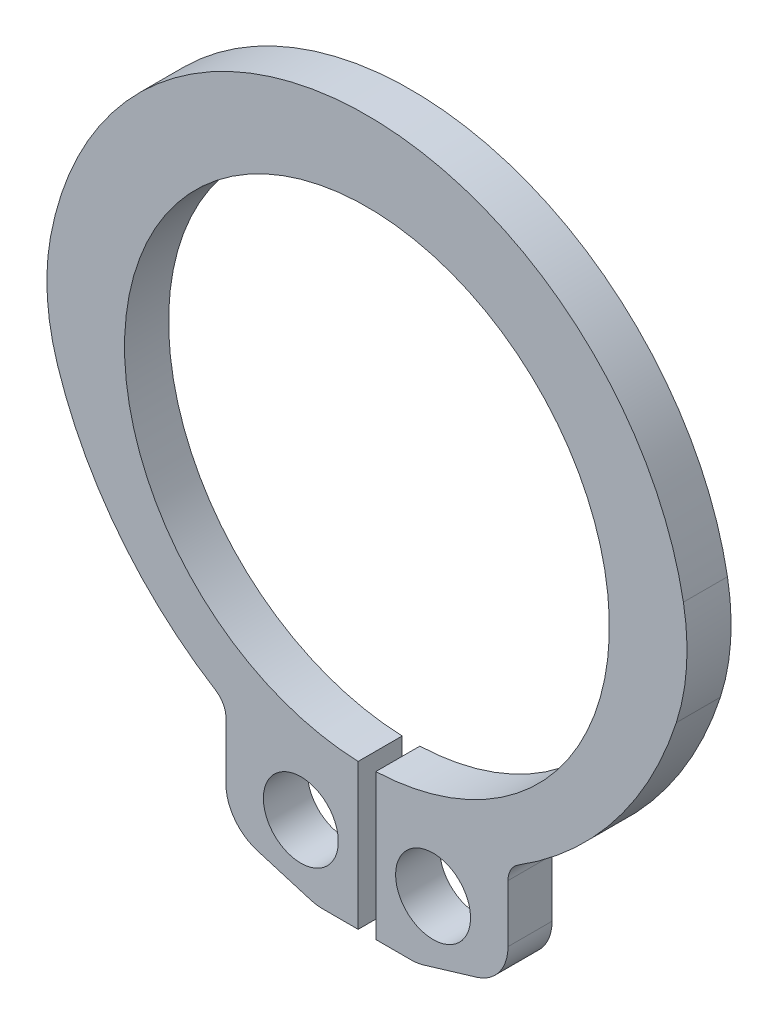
ISO-10303-21;
HEADER;
FILE_DESCRIPTION(('STEP AP214'),'2;1');
FILE_NAME('part.step','',(''),(''),'','','');
FILE_SCHEMA(('AUTOMOTIVE_DESIGN { 1 0 10303 214 1 1 1 1 }'));
ENDSEC;
DATA;
#1=APPLICATION_CONTEXT('core data for automotive mechanical design processes');
#2=APPLICATION_PROTOCOL_DEFINITION('international standard','automotive_design',2000,#1);
#3=PRODUCT_CONTEXT('',#1,'mechanical');
#4=PRODUCT('Part','Part','',(#3));
#5=PRODUCT_RELATED_PRODUCT_CATEGORY('part','',(#4));
#6=PRODUCT_DEFINITION_FORMATION('','',#4);
#7=PRODUCT_DEFINITION_CONTEXT('part definition',#1,'design');
#8=PRODUCT_DEFINITION('design','',#6,#7);
#9=PRODUCT_DEFINITION_SHAPE('','',#8);
#10=(LENGTH_UNIT() NAMED_UNIT(*) SI_UNIT(.MILLI.,.METRE.));
#11=(NAMED_UNIT(*) PLANE_ANGLE_UNIT() SI_UNIT($,.RADIAN.));
#12=(NAMED_UNIT(*) SI_UNIT($,.STERADIAN.) SOLID_ANGLE_UNIT());
#13=UNCERTAINTY_MEASURE_WITH_UNIT(LENGTH_MEASURE(1.E-05),#10,'distance_accuracy_value','');
#14=(GEOMETRIC_REPRESENTATION_CONTEXT(3) GLOBAL_UNCERTAINTY_ASSIGNED_CONTEXT((#13)) GLOBAL_UNIT_ASSIGNED_CONTEXT((#10,
#11,#12)) REPRESENTATION_CONTEXT('',''));
#15=CARTESIAN_POINT('',(0.,0.,0.));
#16=DIRECTION('',(0.,0.,1.));
#17=DIRECTION('',(1.,0.,0.));
#18=AXIS2_PLACEMENT_3D('',#15,#16,#17);
#19=CARTESIAN_POINT('',(2.26199310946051,0.416397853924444,0.499999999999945));
#20=DIRECTION('',(0.,0.,-0.999999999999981));
#21=DIRECTION('',(-1.,0.,0.));
#22=AXIS2_PLACEMENT_3D('',#19,#20,#21);
#23=CYLINDRICAL_SURFACE('',#22,5.);
#24=CARTESIAN_POINT('',(2.26199310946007,0.41639785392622,-0.499999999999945));
#25=DIRECTION('',(0.,0.,-0.999999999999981));
#26=DIRECTION('',(-1.,0.,0.));
#27=AXIS2_PLACEMENT_3D('',#24,#25,#26);
#28=CIRCLE('',#27,5.);
#29=CARTESIAN_POINT('',(7.17936943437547,1.32161057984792,-0.499999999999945));
#30=VERTEX_POINT('',#29);
#31=CARTESIAN_POINT('',(7.01817403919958,-1.12591954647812,-0.499999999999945));
#32=VERTEX_POINT('',#31);
#33=EDGE_CURVE('E204',#30,#32,#28,.T.);
#34=ORIENTED_EDGE('',*,*,#33,.F.);
#35=DIRECTION('',(0.,0.,-0.999999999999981));
#36=VECTOR('',#35,1.);
#37=CARTESIAN_POINT('',(7.17936943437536,1.32161057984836,0.499999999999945));
#38=LINE('',#37,#36);
#39=CARTESIAN_POINT('',(7.17936943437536,1.32161057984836,0.499999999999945));
#40=VERTEX_POINT('',#39);
#41=EDGE_CURVE('E11',#40,#30,#38,.T.);
#42=ORIENTED_EDGE('',*,*,#41,.F.);
#43=CARTESIAN_POINT('',(2.26199310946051,0.416397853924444,0.499999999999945));
#44=DIRECTION('',(0.,0.,-0.999999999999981));
#45=DIRECTION('',(-1.,0.,0.));
#46=AXIS2_PLACEMENT_3D('',#43,#44,#45);
#47=CIRCLE('',#46,5.);
#48=CARTESIAN_POINT('',(7.01817403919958,-1.12591954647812,0.499999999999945));
#49=VERTEX_POINT('',#48);
#50=EDGE_CURVE('E261',#40,#49,#47,.T.);
#51=ORIENTED_EDGE('',*,*,#50,.T.);
#52=DIRECTION('',(0.,0.,-0.999999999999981));
#53=VECTOR('',#52,1.);
#54=CARTESIAN_POINT('',(7.01817403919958,-1.12591954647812,0.499999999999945));
#55=LINE('',#54,#53);
#56=EDGE_CURVE('E38',#49,#32,#55,.T.);
#57=ORIENTED_EDGE('',*,*,#56,.T.);
#58=EDGE_LOOP('',(#34,#42,#51,#57));
#59=FACE_BOUND('',#58,.T.);
#60=ADVANCED_FACE('F35',(#59),#23,.T.);
#61=CARTESIAN_POINT('',(0.,0.,0.499999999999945));
#62=DIRECTION('',(0.,0.,-0.999999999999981));
#63=DIRECTION('',(-1.,0.,0.));
#64=AXIS2_PLACEMENT_3D('',#61,#62,#63);
#65=CYLINDRICAL_SURFACE('',#64,7.29999999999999);
#66=CARTESIAN_POINT('',(0.,0.,-0.499999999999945));
#67=DIRECTION('',(0.,0.,-0.999999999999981));
#68=DIRECTION('',(-1.,0.,0.));
#69=AXIS2_PLACEMENT_3D('',#66,#67,#68);
#70=CIRCLE('',#69,7.29999999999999);
#71=CARTESIAN_POINT('',(-7.17936943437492,1.32161057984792,-0.499999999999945));
#72=VERTEX_POINT('',#71);
#73=EDGE_CURVE('E259',#72,#30,#70,.T.);
#74=ORIENTED_EDGE('',*,*,#73,.F.);
#75=DIRECTION('',(0.,0.,-0.999999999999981));
#76=VECTOR('',#75,1.);
#77=CARTESIAN_POINT('',(-7.1793694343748,1.32161057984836,0.499999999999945));
#78=LINE('',#77,#76);
#79=CARTESIAN_POINT('',(-7.1793694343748,1.32161057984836,0.499999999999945));
#80=VERTEX_POINT('',#79);
#81=EDGE_CURVE('E44',#80,#72,#78,.T.);
#82=ORIENTED_EDGE('',*,*,#81,.F.);
#83=CARTESIAN_POINT('',(0.,0.,0.499999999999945));
#84=DIRECTION('',(0.,0.,-0.999999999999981));
#85=DIRECTION('',(-1.,0.,0.));
#86=AXIS2_PLACEMENT_3D('',#83,#84,#85);
#87=CIRCLE('',#86,7.29999999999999);
#88=EDGE_CURVE('E194',#80,#40,#87,.T.);
#89=ORIENTED_EDGE('',*,*,#88,.T.);
#90=ORIENTED_EDGE('',*,*,#41,.T.);
#91=EDGE_LOOP('',(#74,#82,#89,#90));
#92=FACE_BOUND('',#91,.T.);
#93=ADVANCED_FACE('F297',(#92),#65,.T.);
#94=CARTESIAN_POINT('',(-2.26199310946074,0.416397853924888,0.499999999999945));
#95=DIRECTION('',(0.,0.,-0.999999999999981));
#96=DIRECTION('',(-1.,0.,0.));
#97=AXIS2_PLACEMENT_3D('',#94,#95,#96);
#98=CYLINDRICAL_SURFACE('',#97,5.);
#99=CARTESIAN_POINT('',(-2.26199310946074,0.416397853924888,-0.499999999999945));
#100=DIRECTION('',(0.,0.,-0.999999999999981));
#101=DIRECTION('',(-1.,0.,0.));
#102=AXIS2_PLACEMENT_3D('',#99,#100,#101);
#103=CIRCLE('',#102,5.);
#104=CARTESIAN_POINT('',(-7.01817403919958,-1.12591954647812,-0.499999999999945));
#105=VERTEX_POINT('',#104);
#106=EDGE_CURVE('E181',#105,#72,#103,.T.);
#107=ORIENTED_EDGE('',*,*,#106,.F.);
#108=DIRECTION('',(0.,0.,-0.999999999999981));
#109=VECTOR('',#108,1.);
#110=CARTESIAN_POINT('',(-7.01817403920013,-1.12591954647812,0.499999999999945));
#111=LINE('',#110,#109);
#112=CARTESIAN_POINT('',(-7.01817403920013,-1.12591954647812,0.499999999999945));
#113=VERTEX_POINT('',#112);
#114=EDGE_CURVE('E176',#113,#105,#111,.T.);
#115=ORIENTED_EDGE('',*,*,#114,.F.);
#116=CARTESIAN_POINT('',(-2.26199310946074,0.416397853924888,0.499999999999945));
#117=DIRECTION('',(0.,0.,-0.999999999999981));
#118=DIRECTION('',(-1.,0.,0.));
#119=AXIS2_PLACEMENT_3D('',#116,#117,#118);
#120=CIRCLE('',#119,5.);
#121=EDGE_CURVE('E179',#113,#80,#120,.T.);
#122=ORIENTED_EDGE('',*,*,#121,.T.);
#123=ORIENTED_EDGE('',*,*,#81,.T.);
#124=EDGE_LOOP('',(#107,#115,#122,#123));
#125=FACE_BOUND('',#124,.T.);
#126=ADVANCED_FACE('F178',(#125),#98,.T.);
#127=CARTESIAN_POINT('',(1.06941400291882,1.4966946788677,0.499999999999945));
#128=DIRECTION('',(0.,0.,-0.999999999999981));
#129=DIRECTION('',(-1.,0.,0.));
#130=AXIS2_PLACEMENT_3D('',#127,#128,#129);
#131=CYLINDRICAL_SURFACE('',#130,8.50218711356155);
#132=CARTESIAN_POINT('',(1.06941400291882,1.4966946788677,-0.499999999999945));
#133=DIRECTION('',(0.,0.,-0.999999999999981));
#134=DIRECTION('',(-1.,0.,0.));
#135=AXIS2_PLACEMENT_3D('',#132,#133,#134);
#136=CIRCLE('',#135,8.50218711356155);
#137=CARTESIAN_POINT('',(-3.43509693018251,-5.71416983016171,-0.499999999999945));
#138=VERTEX_POINT('',#137);
#139=EDGE_CURVE('E256',#138,#105,#136,.T.);
#140=ORIENTED_EDGE('',*,*,#139,.F.);
#141=DIRECTION('',(0.,0.,-0.999999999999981));
#142=VECTOR('',#141,1.);
#143=CARTESIAN_POINT('',(-3.43509693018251,-5.71416983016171,0.499999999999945));
#144=LINE('',#143,#142);
#145=CARTESIAN_POINT('',(-3.43509693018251,-5.71416983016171,0.499999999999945));
#146=VERTEX_POINT('',#145);
#147=EDGE_CURVE('E186',#146,#138,#144,.T.);
#148=ORIENTED_EDGE('',*,*,#147,.F.);
#149=CARTESIAN_POINT('',(1.06941400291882,1.4966946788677,0.499999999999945));
#150=DIRECTION('',(0.,0.,-0.999999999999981));
#151=DIRECTION('',(-1.,0.,0.));
#152=AXIS2_PLACEMENT_3D('',#149,#150,#151);
#153=CIRCLE('',#152,8.50218711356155);
#154=EDGE_CURVE('E192',#146,#113,#153,.T.);
#155=ORIENTED_EDGE('',*,*,#154,.T.);
#156=ORIENTED_EDGE('',*,*,#114,.T.);
#157=EDGE_LOOP('',(#140,#148,#155,#156));
#158=FACE_BOUND('',#157,.T.);
#159=ADVANCED_FACE('F196',(#158),#131,.T.);
#160=CARTESIAN_POINT('',(-3.70000000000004,-6.13822921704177,0.499999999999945));
#161=DIRECTION('',(0.,0.,-0.999999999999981));
#162=DIRECTION('',(-1.,0.,0.));
#163=AXIS2_PLACEMENT_3D('',#160,#161,#162);
#164=CYLINDRICAL_SURFACE('',#163,0.499999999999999);
#165=CARTESIAN_POINT('',(-3.70000000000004,-6.13822921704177,-0.499999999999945));
#166=DIRECTION('',(0.,0.,0.999999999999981));
#167=DIRECTION('',(1.,0.,0.));
#168=AXIS2_PLACEMENT_3D('',#165,#166,#167);
#169=CIRCLE('',#168,0.499999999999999);
#170=CARTESIAN_POINT('',(-3.20000000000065,-6.13822921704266,-0.499999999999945));
#171=VERTEX_POINT('',#170);
#172=EDGE_CURVE('E253',#171,#138,#169,.T.);
#173=ORIENTED_EDGE('',*,*,#172,.F.);
#174=DIRECTION('',(0.,0.,-0.999999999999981));
#175=VECTOR('',#174,1.);
#176=CARTESIAN_POINT('',(-3.20000000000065,-6.13822921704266,0.499999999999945));
#177=LINE('',#176,#175);
#178=CARTESIAN_POINT('',(-3.20000000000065,-6.13822921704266,0.499999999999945));
#179=VERTEX_POINT('',#178);
#180=EDGE_CURVE('E265',#179,#171,#177,.T.);
#181=ORIENTED_EDGE('',*,*,#180,.F.);
#182=CARTESIAN_POINT('',(-3.70000000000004,-6.13822921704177,0.499999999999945));
#183=DIRECTION('',(0.,0.,0.999999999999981));
#184=DIRECTION('',(1.,0.,0.));
#185=AXIS2_PLACEMENT_3D('',#182,#183,#184);
#186=CIRCLE('',#185,0.499999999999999);
#187=EDGE_CURVE('E197',#179,#146,#186,.T.);
#188=ORIENTED_EDGE('',*,*,#187,.T.);
#189=ORIENTED_EDGE('',*,*,#147,.T.);
#190=EDGE_LOOP('',(#173,#181,#188,#189));
#191=FACE_BOUND('',#190,.T.);
#192=ADVANCED_FACE('F311',(#191),#164,.F.);
#193=CARTESIAN_POINT('',(-3.2000000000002,-7.43585997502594,0.499999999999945));
#194=DIRECTION('',(-1.,0.,0.));
#195=DIRECTION('',(0.,0.,0.999999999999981));
#196=AXIS2_PLACEMENT_3D('',#193,#194,#195);
#197=PLANE('',#196);
#198=DIRECTION('',(0.,0.999999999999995,0.));
#199=VECTOR('',#198,1.);
#200=CARTESIAN_POINT('',(-3.19999999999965,-7.43585997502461,-0.499999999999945));
#201=LINE('',#200,#199);
#202=CARTESIAN_POINT('',(-3.19999999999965,-7.43585997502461,-0.499999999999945));
#203=VERTEX_POINT('',#202);
#204=EDGE_CURVE('E250',#203,#171,#201,.T.);
#205=ORIENTED_EDGE('',*,*,#204,.F.);
#206=DIRECTION('',(0.,0.,-0.999999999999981));
#207=VECTOR('',#206,1.);
#208=CARTESIAN_POINT('',(-3.2000000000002,-7.43585997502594,0.499999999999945));
#209=LINE('',#208,#207);
#210=CARTESIAN_POINT('',(-3.2000000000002,-7.43585997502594,0.499999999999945));
#211=VERTEX_POINT('',#210);
#212=EDGE_CURVE('E267',#211,#203,#209,.T.);
#213=ORIENTED_EDGE('',*,*,#212,.F.);
#214=DIRECTION('',(0.,0.999999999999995,0.));
#215=VECTOR('',#214,1.);
#216=CARTESIAN_POINT('',(-3.2000000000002,-7.43585997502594,0.499999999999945));
#217=LINE('',#216,#215);
#218=EDGE_CURVE('E199',#211,#179,#217,.T.);
#219=ORIENTED_EDGE('',*,*,#218,.T.);
#220=ORIENTED_EDGE('',*,*,#180,.T.);
#221=EDGE_LOOP('',(#205,#213,#219,#220));
#222=FACE_BOUND('',#221,.T.);
#223=ADVANCED_FACE('F314',(#222),#197,.T.);
#224=CARTESIAN_POINT('',(-2.19999999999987,-7.43585997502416,0.499999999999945));
#225=DIRECTION('',(0.,0.,-0.999999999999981));
#226=DIRECTION('',(-1.,0.,0.));
#227=AXIS2_PLACEMENT_3D('',#224,#225,#226);
#228=CYLINDRICAL_SURFACE('',#227,1.);
#229=CARTESIAN_POINT('',(-2.19999999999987,-7.43585997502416,-0.499999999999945));
#230=DIRECTION('',(0.,0.,-0.999999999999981));
#231=DIRECTION('',(-1.,0.,0.));
#232=AXIS2_PLACEMENT_3D('',#229,#230,#231);
#233=CIRCLE('',#232,1.);
#234=CARTESIAN_POINT('',(-2.48746255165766,-8.39365185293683,-0.499999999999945));
#235=VERTEX_POINT('',#234);
#236=EDGE_CURVE('E247',#235,#203,#233,.T.);
#237=ORIENTED_EDGE('',*,*,#236,.F.);
#238=DIRECTION('',(0.,0.,-0.999999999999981));
#239=VECTOR('',#238,1.);
#240=CARTESIAN_POINT('',(-2.48746255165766,-8.39365185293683,0.499999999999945));
#241=LINE('',#240,#239);
#242=CARTESIAN_POINT('',(-2.48746255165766,-8.39365185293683,0.499999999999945));
#243=VERTEX_POINT('',#242);
#244=EDGE_CURVE('E269',#243,#235,#241,.T.);
#245=ORIENTED_EDGE('',*,*,#244,.F.);
#246=CARTESIAN_POINT('',(-2.19999999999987,-7.43585997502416,0.499999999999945));
#247=DIRECTION('',(0.,0.,-0.999999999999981));
#248=DIRECTION('',(-1.,0.,0.));
#249=AXIS2_PLACEMENT_3D('',#246,#247,#248);
#250=CIRCLE('',#249,1.);
#251=EDGE_CURVE('E447',#243,#211,#250,.T.);
#252=ORIENTED_EDGE('',*,*,#251,.T.);
#253=ORIENTED_EDGE('',*,*,#212,.T.);
#254=EDGE_LOOP('',(#237,#245,#252,#253));
#255=FACE_BOUND('',#254,.T.);
#256=ADVANCED_FACE('F318',(#255),#228,.T.);
#257=CARTESIAN_POINT('',(-1.28631017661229,-8.75415431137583,0.499999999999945));
#258=DIRECTION('',(-0.287462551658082,-0.957791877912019,0.));
#259=DIRECTION('',(0.957791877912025,-0.287462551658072,0.));
#260=AXIS2_PLACEMENT_3D('',#257,#258,#259);
#261=PLANE('',#260);
#262=DIRECTION('',(-0.957791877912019,0.28746255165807,0.));
#263=VECTOR('',#262,1.);
#264=CARTESIAN_POINT('',(-1.28631017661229,-8.75415431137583,-0.499999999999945));
#265=LINE('',#264,#263);
#266=CARTESIAN_POINT('',(-1.28631017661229,-8.75415431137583,-0.499999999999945));
#267=VERTEX_POINT('',#266);
#268=EDGE_CURVE('E244',#267,#235,#265,.T.);
#269=ORIENTED_EDGE('',*,*,#268,.F.);
#270=DIRECTION('',(0.,0.,-0.999999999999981));
#271=VECTOR('',#270,1.);
#272=CARTESIAN_POINT('',(-1.28631017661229,-8.75415431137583,0.499999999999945));
#273=LINE('',#272,#271);
#274=CARTESIAN_POINT('',(-1.28631017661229,-8.75415431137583,0.499999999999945));
#275=VERTEX_POINT('',#274);
#276=EDGE_CURVE('E271',#275,#267,#273,.T.);
#277=ORIENTED_EDGE('',*,*,#276,.F.);
#278=DIRECTION('',(-0.957791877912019,0.28746255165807,0.));
#279=VECTOR('',#278,1.);
#280=CARTESIAN_POINT('',(-1.28631017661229,-8.75415431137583,0.499999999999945));
#281=LINE('',#280,#279);
#282=EDGE_CURVE('E444',#275,#243,#281,.T.);
#283=ORIENTED_EDGE('',*,*,#282,.T.);
#284=ORIENTED_EDGE('',*,*,#244,.T.);
#285=EDGE_LOOP('',(#269,#277,#283,#284));
#286=FACE_BOUND('',#285,.T.);
#287=ADVANCED_FACE('F322',(#286),#261,.T.);
#288=CARTESIAN_POINT('',(-0.998847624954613,-7.79636243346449,0.499999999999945));
#289=DIRECTION('',(0.,0.,-0.999999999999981));
#290=DIRECTION('',(-1.,0.,0.));
#291=AXIS2_PLACEMENT_3D('',#288,#289,#290);
#292=CYLINDRICAL_SURFACE('',#291,1.);
#293=CARTESIAN_POINT('',(-0.998847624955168,-7.79636243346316,-0.499999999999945));
#294=DIRECTION('',(0.,0.,-0.999999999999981));
#295=DIRECTION('',(-1.,0.,0.));
#296=AXIS2_PLACEMENT_3D('',#293,#294,#295);
#297=CIRCLE('',#296,1.);
#298=CARTESIAN_POINT('',(-0.998847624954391,-8.79636243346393,-0.499999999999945));
#299=VERTEX_POINT('',#298);
#300=EDGE_CURVE('E241',#299,#267,#297,.T.);
#301=ORIENTED_EDGE('',*,*,#300,.F.);
#302=DIRECTION('',(0.,0.,-0.999999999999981));
#303=VECTOR('',#302,1.);
#304=CARTESIAN_POINT('',(-0.998847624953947,-8.79636243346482,0.499999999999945));
#305=LINE('',#304,#303);
#306=CARTESIAN_POINT('',(-0.998847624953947,-8.79636243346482,0.499999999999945));
#307=VERTEX_POINT('',#306);
#308=EDGE_CURVE('E273',#307,#299,#305,.T.);
#309=ORIENTED_EDGE('',*,*,#308,.F.);
#310=CARTESIAN_POINT('',(-0.998847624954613,-7.79636243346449,0.499999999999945));
#311=DIRECTION('',(0.,0.,-0.999999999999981));
#312=DIRECTION('',(-1.,0.,0.));
#313=AXIS2_PLACEMENT_3D('',#310,#311,#312);
#314=CIRCLE('',#313,1.);
#315=EDGE_CURVE('E441',#307,#275,#314,.T.);
#316=ORIENTED_EDGE('',*,*,#315,.T.);
#317=ORIENTED_EDGE('',*,*,#276,.T.);
#318=EDGE_LOOP('',(#301,#309,#316,#317));
#319=FACE_BOUND('',#318,.T.);
#320=ADVANCED_FACE('F326',(#319),#292,.T.);
#321=CARTESIAN_POINT('',(-0.200000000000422,-8.79636243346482,0.499999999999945));
#322=DIRECTION('',(0.,-0.999999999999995,0.));
#323=DIRECTION('',(0.,0.,-0.999999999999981));
#324=AXIS2_PLACEMENT_3D('',#321,#322,#323);
#325=PLANE('',#324);
#326=DIRECTION('',(-1.,0.,0.));
#327=VECTOR('',#326,1.);
#328=CARTESIAN_POINT('',(-0.200000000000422,-8.79636243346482,-0.499999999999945));
#329=LINE('',#328,#327);
#330=CARTESIAN_POINT('',(-0.200000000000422,-8.79636243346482,-0.499999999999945));
#331=VERTEX_POINT('',#330);
#332=EDGE_CURVE('E238',#331,#299,#329,.T.);
#333=ORIENTED_EDGE('',*,*,#332,.F.);
#334=DIRECTION('',(0.,0.,-0.999999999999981));
#335=VECTOR('',#334,1.);
#336=CARTESIAN_POINT('',(-0.200000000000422,-8.79636243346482,0.499999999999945));
#337=LINE('',#336,#335);
#338=CARTESIAN_POINT('',(-0.200000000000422,-8.79636243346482,0.499999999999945));
#339=VERTEX_POINT('',#338);
#340=EDGE_CURVE('E275',#339,#331,#337,.T.);
#341=ORIENTED_EDGE('',*,*,#340,.F.);
#342=DIRECTION('',(-1.,0.,0.));
#343=VECTOR('',#342,1.);
#344=CARTESIAN_POINT('',(-0.200000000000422,-8.79636243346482,0.499999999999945));
#345=LINE('',#344,#343);
#346=EDGE_CURVE('E438',#339,#307,#345,.T.);
#347=ORIENTED_EDGE('',*,*,#346,.T.);
#348=ORIENTED_EDGE('',*,*,#308,.T.);
#349=EDGE_LOOP('',(#333,#341,#347,#348));
#350=FACE_BOUND('',#349,.T.);
#351=ADVANCED_FACE('F330',(#350),#325,.T.);
#352=CARTESIAN_POINT('',(-0.200000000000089,-5.49636243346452,0.499999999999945));
#353=DIRECTION('',(1.,0.,0.));
#354=DIRECTION('',(0.,0.,-0.999999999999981));
#355=AXIS2_PLACEMENT_3D('',#352,#353,#354);
#356=PLANE('',#355);
#357=DIRECTION('',(0.,-0.999999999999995,0.));
#358=VECTOR('',#357,1.);
#359=CARTESIAN_POINT('',(-0.200000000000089,-5.49636243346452,-0.499999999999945));
#360=LINE('',#359,#358);
#361=CARTESIAN_POINT('',(-0.200000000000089,-5.49636243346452,-0.499999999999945));
#362=VERTEX_POINT('',#361);
#363=EDGE_CURVE('E235',#362,#331,#360,.T.);
#364=ORIENTED_EDGE('',*,*,#363,.F.);
#365=DIRECTION('',(0.,0.,-0.999999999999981));
#366=VECTOR('',#365,1.);
#367=CARTESIAN_POINT('',(-0.200000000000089,-5.49636243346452,0.499999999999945));
#368=LINE('',#367,#366);
#369=CARTESIAN_POINT('',(-0.200000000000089,-5.49636243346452,0.499999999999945));
#370=VERTEX_POINT('',#369);
#371=EDGE_CURVE('E277',#370,#362,#368,.T.);
#372=ORIENTED_EDGE('',*,*,#371,.F.);
#373=DIRECTION('',(0.,-0.999999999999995,0.));
#374=VECTOR('',#373,1.);
#375=CARTESIAN_POINT('',(-0.200000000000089,-5.49636243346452,0.499999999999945));
#376=LINE('',#375,#374);
#377=EDGE_CURVE('E435',#370,#339,#376,.T.);
#378=ORIENTED_EDGE('',*,*,#377,.T.);
#379=ORIENTED_EDGE('',*,*,#340,.T.);
#380=EDGE_LOOP('',(#364,#372,#378,#379));
#381=FACE_BOUND('',#380,.T.);
#382=ADVANCED_FACE('F334',(#381),#356,.T.);
#383=CARTESIAN_POINT('',(0.,0.,0.499999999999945));
#384=DIRECTION('',(0.,0.,-0.999999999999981));
#385=DIRECTION('',(-1.,0.,0.));
#386=AXIS2_PLACEMENT_3D('',#383,#384,#385);
#387=CYLINDRICAL_SURFACE('',#386,5.5);
#388=CARTESIAN_POINT('',(0.,0.,-0.499999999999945));
#389=DIRECTION('',(0.,0.,0.999999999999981));
#390=DIRECTION('',(1.,0.,0.));
#391=AXIS2_PLACEMENT_3D('',#388,#389,#390);
#392=CIRCLE('',#391,5.5);
#393=CARTESIAN_POINT('',(0.199999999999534,-5.49636243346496,-0.499999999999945));
#394=VERTEX_POINT('',#393);
#395=EDGE_CURVE('E232',#394,#362,#392,.T.);
#396=ORIENTED_EDGE('',*,*,#395,.F.);
#397=DIRECTION('',(0.,0.,-0.999999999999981));
#398=VECTOR('',#397,1.);
#399=CARTESIAN_POINT('',(0.199999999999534,-5.49636243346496,0.499999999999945));
#400=LINE('',#399,#398);
#401=CARTESIAN_POINT('',(0.199999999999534,-5.49636243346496,0.499999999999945));
#402=VERTEX_POINT('',#401);
#403=EDGE_CURVE('E279',#402,#394,#400,.T.);
#404=ORIENTED_EDGE('',*,*,#403,.F.);
#405=CARTESIAN_POINT('',(0.,0.,0.499999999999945));
#406=DIRECTION('',(0.,0.,0.999999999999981));
#407=DIRECTION('',(1.,0.,0.));
#408=AXIS2_PLACEMENT_3D('',#405,#406,#407);
#409=CIRCLE('',#408,5.5);
#410=EDGE_CURVE('E432',#402,#370,#409,.T.);
#411=ORIENTED_EDGE('',*,*,#410,.T.);
#412=ORIENTED_EDGE('',*,*,#371,.T.);
#413=EDGE_LOOP('',(#396,#404,#411,#412));
#414=FACE_BOUND('',#413,.T.);
#415=ADVANCED_FACE('F338',(#414),#387,.F.);
#416=CARTESIAN_POINT('',(0.199999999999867,-8.79636243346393,0.499999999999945));
#417=DIRECTION('',(-1.,0.,0.));
#418=DIRECTION('',(0.,0.,0.999999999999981));
#419=AXIS2_PLACEMENT_3D('',#416,#417,#418);
#420=PLANE('',#419);
#421=DIRECTION('',(0.,0.999999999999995,0.));
#422=VECTOR('',#421,1.);
#423=CARTESIAN_POINT('',(0.199999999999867,-8.79636243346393,-0.499999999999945));
#424=LINE('',#423,#422);
#425=CARTESIAN_POINT('',(0.199999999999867,-8.79636243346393,-0.499999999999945));
#426=VERTEX_POINT('',#425);
#427=EDGE_CURVE('E229',#426,#394,#424,.T.);
#428=ORIENTED_EDGE('',*,*,#427,.F.);
#429=DIRECTION('',(0.,0.,-0.999999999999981));
#430=VECTOR('',#429,1.);
#431=CARTESIAN_POINT('',(0.199999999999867,-8.79636243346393,0.499999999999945));
#432=LINE('',#431,#430);
#433=CARTESIAN_POINT('',(0.199999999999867,-8.79636243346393,0.499999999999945));
#434=VERTEX_POINT('',#433);
#435=EDGE_CURVE('E281',#434,#426,#432,.T.);
#436=ORIENTED_EDGE('',*,*,#435,.F.);
#437=DIRECTION('',(0.,0.999999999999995,0.));
#438=VECTOR('',#437,1.);
#439=CARTESIAN_POINT('',(0.199999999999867,-8.79636243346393,0.499999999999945));
#440=LINE('',#439,#438);
#441=EDGE_CURVE('E429',#434,#402,#440,.T.);
#442=ORIENTED_EDGE('',*,*,#441,.T.);
#443=ORIENTED_EDGE('',*,*,#403,.T.);
#444=EDGE_LOOP('',(#428,#436,#442,#443));
#445=FACE_BOUND('',#444,.T.);
#446=ADVANCED_FACE('F342',(#445),#420,.T.);
#447=CARTESIAN_POINT('',(0.998847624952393,-8.79636243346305,0.499999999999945));
#448=DIRECTION('',(0.,-0.999999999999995,0.));
#449=DIRECTION('',(0.,0.,-0.999999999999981));
#450=AXIS2_PLACEMENT_3D('',#447,#448,#449);
#451=PLANE('',#450);
#452=DIRECTION('',(-1.,0.,0.));
#453=VECTOR('',#452,1.);
#454=CARTESIAN_POINT('',(0.998847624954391,-8.79636243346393,-0.499999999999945));
#455=LINE('',#454,#453);
#456=CARTESIAN_POINT('',(0.998847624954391,-8.79636243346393,-0.499999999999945));
#457=VERTEX_POINT('',#456);
#458=EDGE_CURVE('E226',#457,#426,#455,.T.);
#459=ORIENTED_EDGE('',*,*,#458,.F.);
#460=DIRECTION('',(0.,0.,-0.999999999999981));
#461=VECTOR('',#460,1.);
#462=CARTESIAN_POINT('',(0.998847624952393,-8.79636243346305,0.499999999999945));
#463=LINE('',#462,#461);
#464=CARTESIAN_POINT('',(0.998847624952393,-8.79636243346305,0.499999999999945));
#465=VERTEX_POINT('',#464);
#466=EDGE_CURVE('E283',#465,#457,#463,.T.);
#467=ORIENTED_EDGE('',*,*,#466,.F.);
#468=DIRECTION('',(-1.,0.,0.));
#469=VECTOR('',#468,1.);
#470=CARTESIAN_POINT('',(0.998847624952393,-8.79636243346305,0.499999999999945));
#471=LINE('',#470,#469);
#472=EDGE_CURVE('E426',#465,#434,#471,.T.);
#473=ORIENTED_EDGE('',*,*,#472,.T.);
#474=ORIENTED_EDGE('',*,*,#435,.T.);
#475=EDGE_LOOP('',(#459,#467,#473,#474));
#476=FACE_BOUND('',#475,.T.);
#477=ADVANCED_FACE('F346',(#476),#451,.T.);
#478=CARTESIAN_POINT('',(0.998847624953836,-7.7963624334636,0.499999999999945));
#479=DIRECTION('',(0.,0.,-0.999999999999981));
#480=DIRECTION('',(-1.,0.,0.));
#481=AXIS2_PLACEMENT_3D('',#478,#479,#480);
#482=CYLINDRICAL_SURFACE('',#481,1.);
#483=CARTESIAN_POINT('',(0.998847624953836,-7.7963624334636,-0.499999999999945));
#484=DIRECTION('',(0.,0.,-0.999999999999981));
#485=DIRECTION('',(-1.,0.,0.));
#486=AXIS2_PLACEMENT_3D('',#483,#484,#485);
#487=CIRCLE('',#486,1.);
#488=CARTESIAN_POINT('',(1.28631017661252,-8.75415431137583,-0.499999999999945));
#489=VERTEX_POINT('',#488);
#490=EDGE_CURVE('E223',#489,#457,#487,.T.);
#491=ORIENTED_EDGE('',*,*,#490,.F.);
#492=DIRECTION('',(0.,0.,-0.999999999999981));
#493=VECTOR('',#492,1.);
#494=CARTESIAN_POINT('',(1.28631017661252,-8.75415431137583,0.499999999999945));
#495=LINE('',#494,#493);
#496=CARTESIAN_POINT('',(1.28631017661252,-8.75415431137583,0.499999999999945));
#497=VERTEX_POINT('',#496);
#498=EDGE_CURVE('E285',#497,#489,#495,.T.);
#499=ORIENTED_EDGE('',*,*,#498,.F.);
#500=CARTESIAN_POINT('',(0.998847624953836,-7.7963624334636,0.499999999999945));
#501=DIRECTION('',(0.,0.,-0.999999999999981));
#502=DIRECTION('',(-1.,0.,0.));
#503=AXIS2_PLACEMENT_3D('',#500,#501,#502);
#504=CIRCLE('',#503,1.);
#505=EDGE_CURVE('E423',#497,#465,#504,.T.);
#506=ORIENTED_EDGE('',*,*,#505,.T.);
#507=ORIENTED_EDGE('',*,*,#466,.T.);
#508=EDGE_LOOP('',(#491,#499,#506,#507));
#509=FACE_BOUND('',#508,.T.);
#510=ADVANCED_FACE('F350',(#509),#482,.T.);
#511=CARTESIAN_POINT('',(2.4874625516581,-8.39365185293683,0.499999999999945));
#512=DIRECTION('',(0.287462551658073,-0.957791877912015,0.));
#513=DIRECTION('',(0.957791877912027,0.287462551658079,0.));
#514=AXIS2_PLACEMENT_3D('',#511,#512,#513);
#515=PLANE('',#514);
#516=DIRECTION('',(-0.957791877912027,-0.287462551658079,0.));
#517=VECTOR('',#516,1.);
#518=CARTESIAN_POINT('',(2.4874625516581,-8.39365185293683,-0.499999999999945));
#519=LINE('',#518,#517);
#520=CARTESIAN_POINT('',(2.4874625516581,-8.39365185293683,-0.499999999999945));
#521=VERTEX_POINT('',#520);
#522=EDGE_CURVE('E220',#521,#489,#519,.T.);
#523=ORIENTED_EDGE('',*,*,#522,.F.);
#524=DIRECTION('',(0.,0.,-0.999999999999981));
#525=VECTOR('',#524,1.);
#526=CARTESIAN_POINT('',(2.4874625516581,-8.39365185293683,0.499999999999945));
#527=LINE('',#526,#525);
#528=CARTESIAN_POINT('',(2.4874625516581,-8.39365185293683,0.499999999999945));
#529=VERTEX_POINT('',#528);
#530=EDGE_CURVE('E287',#529,#521,#527,.T.);
#531=ORIENTED_EDGE('',*,*,#530,.F.);
#532=DIRECTION('',(-0.957791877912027,-0.287462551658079,0.));
#533=VECTOR('',#532,1.);
#534=CARTESIAN_POINT('',(2.4874625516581,-8.39365185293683,0.499999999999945));
#535=LINE('',#534,#533);
#536=EDGE_CURVE('E420',#529,#497,#535,.T.);
#537=ORIENTED_EDGE('',*,*,#536,.T.);
#538=ORIENTED_EDGE('',*,*,#498,.T.);
#539=EDGE_LOOP('',(#523,#531,#537,#538));
#540=FACE_BOUND('',#539,.T.);
#541=ADVANCED_FACE('F354',(#540),#515,.T.);
#542=CARTESIAN_POINT('',(2.20000000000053,-7.43585997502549,0.499999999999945));
#543=DIRECTION('',(0.,0.,-0.999999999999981));
#544=DIRECTION('',(-1.,0.,0.));
#545=AXIS2_PLACEMENT_3D('',#542,#543,#544);
#546=CYLINDRICAL_SURFACE('',#545,1.);
#547=CARTESIAN_POINT('',(2.20000000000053,-7.43585997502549,-0.499999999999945));
#548=DIRECTION('',(0.,0.,-0.999999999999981));
#549=DIRECTION('',(-1.,0.,0.));
#550=AXIS2_PLACEMENT_3D('',#547,#548,#549);
#551=CIRCLE('',#550,1.);
#552=CARTESIAN_POINT('',(3.19999999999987,-7.43585997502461,-0.499999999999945));
#553=VERTEX_POINT('',#552);
#554=EDGE_CURVE('E217',#553,#521,#551,.T.);
#555=ORIENTED_EDGE('',*,*,#554,.F.);
#556=DIRECTION('',(0.,0.,-0.999999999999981));
#557=VECTOR('',#556,1.);
#558=CARTESIAN_POINT('',(3.19999999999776,-7.43585997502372,0.499999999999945));
#559=LINE('',#558,#557);
#560=CARTESIAN_POINT('',(3.19999999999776,-7.43585997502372,0.499999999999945));
#561=VERTEX_POINT('',#560);
#562=EDGE_CURVE('E289',#561,#553,#559,.T.);
#563=ORIENTED_EDGE('',*,*,#562,.F.);
#564=CARTESIAN_POINT('',(2.20000000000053,-7.43585997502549,0.499999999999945));
#565=DIRECTION('',(0.,0.,-0.999999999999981));
#566=DIRECTION('',(-1.,0.,0.));
#567=AXIS2_PLACEMENT_3D('',#564,#565,#566);
#568=CIRCLE('',#567,1.);
#569=EDGE_CURVE('E417',#561,#529,#568,.T.);
#570=ORIENTED_EDGE('',*,*,#569,.T.);
#571=ORIENTED_EDGE('',*,*,#530,.T.);
#572=EDGE_LOOP('',(#555,#563,#570,#571));
#573=FACE_BOUND('',#572,.T.);
#574=ADVANCED_FACE('F358',(#573),#546,.T.);
#575=CARTESIAN_POINT('',(3.20000000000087,-6.13822921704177,0.499999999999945));
#576=DIRECTION('',(1.,0.,0.));
#577=DIRECTION('',(0.,0.,-0.999999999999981));
#578=AXIS2_PLACEMENT_3D('',#575,#576,#577);
#579=PLANE('',#578);
#580=DIRECTION('',(0.,-0.999999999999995,0.));
#581=VECTOR('',#580,1.);
#582=CARTESIAN_POINT('',(3.20000000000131,-6.13822921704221,-0.499999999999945));
#583=LINE('',#582,#581);
#584=CARTESIAN_POINT('',(3.20000000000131,-6.13822921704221,-0.499999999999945));
#585=VERTEX_POINT('',#584);
#586=EDGE_CURVE('E214',#585,#553,#583,.T.);
#587=ORIENTED_EDGE('',*,*,#586,.F.);
#588=DIRECTION('',(0.,0.,-0.999999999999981));
#589=VECTOR('',#588,1.);
#590=CARTESIAN_POINT('',(3.20000000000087,-6.13822921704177,0.499999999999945));
#591=LINE('',#590,#589);
#592=CARTESIAN_POINT('',(3.20000000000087,-6.13822921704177,0.499999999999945));
#593=VERTEX_POINT('',#592);
#594=EDGE_CURVE('E291',#593,#585,#591,.T.);
#595=ORIENTED_EDGE('',*,*,#594,.F.);
#596=DIRECTION('',(0.,-0.999999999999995,0.));
#597=VECTOR('',#596,1.);
#598=CARTESIAN_POINT('',(3.20000000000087,-6.13822921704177,0.499999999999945));
#599=LINE('',#598,#597);
#600=EDGE_CURVE('E414',#593,#561,#599,.T.);
#601=ORIENTED_EDGE('',*,*,#600,.T.);
#602=ORIENTED_EDGE('',*,*,#562,.T.);
#603=EDGE_LOOP('',(#587,#595,#601,#602));
#604=FACE_BOUND('',#603,.T.);
#605=ADVANCED_FACE('F362',(#604),#579,.T.);
#606=CARTESIAN_POINT('',(3.69999999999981,-6.13822921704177,0.499999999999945));
#607=DIRECTION('',(0.,0.,-0.999999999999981));
#608=DIRECTION('',(-1.,0.,0.));
#609=AXIS2_PLACEMENT_3D('',#606,#607,#608);
#610=CYLINDRICAL_SURFACE('',#609,0.500000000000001);
#611=CARTESIAN_POINT('',(3.69999999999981,-6.13822921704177,-0.499999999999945));
#612=DIRECTION('',(0.,0.,0.999999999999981));
#613=DIRECTION('',(1.,0.,0.));
#614=AXIS2_PLACEMENT_3D('',#611,#612,#613);
#615=CIRCLE('',#614,0.500000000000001);
#616=CARTESIAN_POINT('',(3.43509693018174,-5.7141698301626,-0.499999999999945));
#617=VERTEX_POINT('',#616);
#618=EDGE_CURVE('E211',#617,#585,#615,.T.);
#619=ORIENTED_EDGE('',*,*,#618,.F.);
#620=DIRECTION('',(0.,0.,-0.999999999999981));
#621=VECTOR('',#620,1.);
#622=CARTESIAN_POINT('',(3.4350969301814,-5.71416983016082,0.499999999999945));
#623=LINE('',#622,#621);
#624=CARTESIAN_POINT('',(3.4350969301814,-5.71416983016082,0.499999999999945));
#625=VERTEX_POINT('',#624);
#626=EDGE_CURVE('E292',#625,#617,#623,.T.);
#627=ORIENTED_EDGE('',*,*,#626,.F.);
#628=CARTESIAN_POINT('',(3.69999999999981,-6.13822921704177,0.499999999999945));
#629=DIRECTION('',(0.,0.,0.999999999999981));
#630=DIRECTION('',(1.,0.,0.));
#631=AXIS2_PLACEMENT_3D('',#628,#629,#630);
#632=CIRCLE('',#631,0.500000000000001);
#633=EDGE_CURVE('E411',#625,#593,#632,.T.);
#634=ORIENTED_EDGE('',*,*,#633,.T.);
#635=ORIENTED_EDGE('',*,*,#594,.T.);
#636=EDGE_LOOP('',(#619,#627,#634,#635));
#637=FACE_BOUND('',#636,.T.);
#638=ADVANCED_FACE('F366',(#637),#610,.F.);
#639=CARTESIAN_POINT('',(-1.06941400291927,1.4966946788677,0.499999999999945));
#640=DIRECTION('',(0.,0.,-0.999999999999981));
#641=DIRECTION('',(-1.,0.,0.));
#642=AXIS2_PLACEMENT_3D('',#639,#640,#641);
#643=CYLINDRICAL_SURFACE('',#642,8.50218711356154);
#644=CARTESIAN_POINT('',(-1.06941400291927,1.4966946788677,-0.499999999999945));
#645=DIRECTION('',(0.,0.,-0.999999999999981));
#646=DIRECTION('',(-1.,0.,0.));
#647=AXIS2_PLACEMENT_3D('',#644,#645,#646);
#648=CIRCLE('',#647,8.50218711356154);
#649=EDGE_CURVE('E207',#32,#617,#648,.T.);
#650=ORIENTED_EDGE('',*,*,#649,.F.);
#651=ORIENTED_EDGE('',*,*,#56,.F.);
#652=CARTESIAN_POINT('',(-1.06941400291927,1.4966946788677,0.499999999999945));
#653=DIRECTION('',(0.,0.,-0.999999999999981));
#654=DIRECTION('',(-1.,0.,0.));
#655=AXIS2_PLACEMENT_3D('',#652,#653,#654);
#656=CIRCLE('',#655,8.50218711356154);
#657=EDGE_CURVE('E409',#49,#625,#656,.T.);
#658=ORIENTED_EDGE('',*,*,#657,.T.);
#659=ORIENTED_EDGE('',*,*,#626,.T.);
#660=EDGE_LOOP('',(#650,#651,#658,#659));
#661=FACE_BOUND('',#660,.T.);
#662=ADVANCED_FACE('F294',(#661),#643,.T.);
#663=CARTESIAN_POINT('',(2.26199310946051,0.416397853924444,0.499999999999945));
#664=DIRECTION('',(0.,0.,-0.999999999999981));
#665=DIRECTION('',(-1.,0.,0.));
#666=AXIS2_PLACEMENT_3D('',#663,#664,#665);
#667=PLANE('',#666);
#668=CARTESIAN_POINT('',(-1.49999999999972,-7.29636243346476,0.499999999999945));
#669=DIRECTION('',(0.,0.,-0.999999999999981));
#670=DIRECTION('',(1.,0.,0.));
#671=AXIS2_PLACEMENT_3D('',#668,#669,#670);
#672=CIRCLE('',#671,0.85);
#673=CARTESIAN_POINT('',(-2.34999999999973,-7.29636243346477,0.499999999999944));
#674=VERTEX_POINT('',#673);
#675=EDGE_CURVE('E396',#674,#674,#672,.T.);
#676=ORIENTED_EDGE('',*,*,#675,.T.);
#677=EDGE_LOOP('',(#676));
#678=FACE_BOUND('',#677,.T.);
#679=CARTESIAN_POINT('',(1.49999999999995,-7.29636243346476,0.499999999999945));
#680=DIRECTION('',(0.,0.,-0.999999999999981));
#681=DIRECTION('',(1.,0.,0.));
#682=AXIS2_PLACEMENT_3D('',#679,#680,#681);
#683=CIRCLE('',#682,0.85);
#684=CARTESIAN_POINT('',(0.649999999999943,-7.29636243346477,0.499999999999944));
#685=VERTEX_POINT('',#684);
#686=EDGE_CURVE('E208',#685,#685,#683,.T.);
#687=ORIENTED_EDGE('',*,*,#686,.T.);
#688=EDGE_LOOP('',(#687));
#689=FACE_BOUND('',#688,.T.);
#690=ORIENTED_EDGE('',*,*,#50,.F.);
#691=ORIENTED_EDGE('',*,*,#88,.F.);
#692=ORIENTED_EDGE('',*,*,#121,.F.);
#693=ORIENTED_EDGE('',*,*,#154,.F.);
#694=ORIENTED_EDGE('',*,*,#187,.F.);
#695=ORIENTED_EDGE('',*,*,#218,.F.);
#696=ORIENTED_EDGE('',*,*,#251,.F.);
#697=ORIENTED_EDGE('',*,*,#282,.F.);
#698=ORIENTED_EDGE('',*,*,#315,.F.);
#699=ORIENTED_EDGE('',*,*,#346,.F.);
#700=ORIENTED_EDGE('',*,*,#377,.F.);
#701=ORIENTED_EDGE('',*,*,#410,.F.);
#702=ORIENTED_EDGE('',*,*,#441,.F.);
#703=ORIENTED_EDGE('',*,*,#472,.F.);
#704=ORIENTED_EDGE('',*,*,#505,.F.);
#705=ORIENTED_EDGE('',*,*,#536,.F.);
#706=ORIENTED_EDGE('',*,*,#569,.F.);
#707=ORIENTED_EDGE('',*,*,#600,.F.);
#708=ORIENTED_EDGE('',*,*,#633,.F.);
#709=ORIENTED_EDGE('',*,*,#657,.F.);
#710=EDGE_LOOP('',(#690,#691,#692,#693,#694,#695,#696,#697,#698,#699,#700,#701,#702,#703,#704,
#705,#706,#707,#708,#709));
#711=FACE_BOUND('',#710,.T.);
#712=ADVANCED_FACE('F190',(#678,#689,#711),#667,.F.);
#713=CARTESIAN_POINT('',(2.26199310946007,0.41639785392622,-0.499999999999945));
#714=DIRECTION('',(0.,0.,-0.999999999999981));
#715=DIRECTION('',(-1.,0.,0.));
#716=AXIS2_PLACEMENT_3D('',#713,#714,#715);
#717=PLANE('',#716);
#718=CARTESIAN_POINT('',(-1.49999999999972,-7.29636243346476,-0.499999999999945));
#719=DIRECTION('',(0.,0.,-0.999999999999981));
#720=DIRECTION('',(1.,0.,0.));
#721=AXIS2_PLACEMENT_3D('',#718,#719,#720);
#722=CIRCLE('',#721,0.85);
#723=CARTESIAN_POINT('',(-2.34999999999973,-7.29636243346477,-0.499999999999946));
#724=VERTEX_POINT('',#723);
#725=EDGE_CURVE('E399',#724,#724,#722,.T.);
#726=ORIENTED_EDGE('',*,*,#725,.F.);
#727=EDGE_LOOP('',(#726));
#728=FACE_BOUND('',#727,.T.);
#729=CARTESIAN_POINT('',(1.49999999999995,-7.29636243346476,-0.499999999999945));
#730=DIRECTION('',(0.,0.,-0.999999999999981));
#731=DIRECTION('',(1.,0.,0.));
#732=AXIS2_PLACEMENT_3D('',#729,#730,#731);
#733=CIRCLE('',#732,0.85);
#734=CARTESIAN_POINT('',(0.649999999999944,-7.29636243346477,-0.499999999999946));
#735=VERTEX_POINT('',#734);
#736=EDGE_CURVE('E401',#735,#735,#733,.T.);
#737=ORIENTED_EDGE('',*,*,#736,.F.);
#738=EDGE_LOOP('',(#737));
#739=FACE_BOUND('',#738,.T.);
#740=ORIENTED_EDGE('',*,*,#33,.T.);
#741=ORIENTED_EDGE('',*,*,#649,.T.);
#742=ORIENTED_EDGE('',*,*,#618,.T.);
#743=ORIENTED_EDGE('',*,*,#586,.T.);
#744=ORIENTED_EDGE('',*,*,#554,.T.);
#745=ORIENTED_EDGE('',*,*,#522,.T.);
#746=ORIENTED_EDGE('',*,*,#490,.T.);
#747=ORIENTED_EDGE('',*,*,#458,.T.);
#748=ORIENTED_EDGE('',*,*,#427,.T.);
#749=ORIENTED_EDGE('',*,*,#395,.T.);
#750=ORIENTED_EDGE('',*,*,#363,.T.);
#751=ORIENTED_EDGE('',*,*,#332,.T.);
#752=ORIENTED_EDGE('',*,*,#300,.T.);
#753=ORIENTED_EDGE('',*,*,#268,.T.);
#754=ORIENTED_EDGE('',*,*,#236,.T.);
#755=ORIENTED_EDGE('',*,*,#204,.T.);
#756=ORIENTED_EDGE('',*,*,#172,.T.);
#757=ORIENTED_EDGE('',*,*,#139,.T.);
#758=ORIENTED_EDGE('',*,*,#106,.T.);
#759=ORIENTED_EDGE('',*,*,#73,.T.);
#760=EDGE_LOOP('',(#740,#741,#742,#743,#744,#745,#746,#747,#748,#749,#750,#751,#752,#753,#754,
#755,#756,#757,#758,#759));
#761=FACE_BOUND('',#760,.T.);
#762=ADVANCED_FACE('F296',(#728,#739,#761),#717,.T.);
#763=CARTESIAN_POINT('',(1.49999999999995,-7.29636243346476,0.499999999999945));
#764=DIRECTION('',(0.,0.,-0.999999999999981));
#765=DIRECTION('',(-1.,0.,0.));
#766=AXIS2_PLACEMENT_3D('',#763,#764,#765);
#767=CYLINDRICAL_SURFACE('',#766,0.85);
#768=CARTESIAN_POINT('',(0.649999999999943,-7.29636243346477,0.499999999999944));
#769=CARTESIAN_POINT('',(0.649999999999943,-7.29636243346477,0.489583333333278));
#770=CARTESIAN_POINT('',(0.649999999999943,-7.29636243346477,0.479166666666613));
#771=CARTESIAN_POINT('',(0.649999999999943,-7.29636243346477,0.458333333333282));
#772=CARTESIAN_POINT('',(0.649999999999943,-7.29636243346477,0.447916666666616));
#773=CARTESIAN_POINT('',(0.649999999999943,-7.29636243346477,0.427083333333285));
#774=CARTESIAN_POINT('',(0.649999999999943,-7.29636243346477,0.41666666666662));
#775=CARTESIAN_POINT('',(0.649999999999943,-7.29636243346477,0.395833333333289));
#776=CARTESIAN_POINT('',(0.649999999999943,-7.29636243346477,0.385416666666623));
#777=CARTESIAN_POINT('',(0.649999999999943,-7.29636243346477,0.364583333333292));
#778=CARTESIAN_POINT('',(0.649999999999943,-7.29636243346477,0.354166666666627));
#779=CARTESIAN_POINT('',(0.649999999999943,-7.29636243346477,0.333333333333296));
#780=CARTESIAN_POINT('',(0.649999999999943,-7.29636243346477,0.32291666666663));
#781=CARTESIAN_POINT('',(0.649999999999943,-7.29636243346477,0.302083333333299));
#782=CARTESIAN_POINT('',(0.649999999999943,-7.29636243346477,0.291666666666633));
#783=CARTESIAN_POINT('',(0.649999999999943,-7.29636243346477,0.270833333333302));
#784=CARTESIAN_POINT('',(0.649999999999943,-7.29636243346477,0.260416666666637));
#785=CARTESIAN_POINT('',(0.649999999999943,-7.29636243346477,0.239583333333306));
#786=CARTESIAN_POINT('',(0.649999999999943,-7.29636243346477,0.22916666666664));
#787=CARTESIAN_POINT('',(0.649999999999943,-7.29636243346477,0.208333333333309));
#788=CARTESIAN_POINT('',(0.649999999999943,-7.29636243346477,0.197916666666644));
#789=CARTESIAN_POINT('',(0.649999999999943,-7.29636243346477,0.177083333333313));
#790=CARTESIAN_POINT('',(0.649999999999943,-7.29636243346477,0.166666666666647));
#791=CARTESIAN_POINT('',(0.649999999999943,-7.29636243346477,0.145833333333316));
#792=CARTESIAN_POINT('',(0.649999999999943,-7.29636243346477,0.135416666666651));
#793=CARTESIAN_POINT('',(0.649999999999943,-7.29636243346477,0.11458333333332));
#794=CARTESIAN_POINT('',(0.649999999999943,-7.29636243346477,0.104166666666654));
#795=CARTESIAN_POINT('',(0.649999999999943,-7.29636243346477,0.0833333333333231));
#796=CARTESIAN_POINT('',(0.649999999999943,-7.29636243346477,0.0729166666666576));
#797=CARTESIAN_POINT('',(0.649999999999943,-7.29636243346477,0.0520833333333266));
#798=CARTESIAN_POINT('',(0.649999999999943,-7.29636243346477,0.0416666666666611));
#799=CARTESIAN_POINT('',(0.649999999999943,-7.29636243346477,0.02083333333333));
#800=CARTESIAN_POINT('',(0.649999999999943,-7.29636243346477,0.0104166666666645));
#801=CARTESIAN_POINT('',(0.649999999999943,-7.29636243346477,-0.0104166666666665));
#802=CARTESIAN_POINT('',(0.649999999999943,-7.29636243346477,-0.020833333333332));
#803=CARTESIAN_POINT('',(0.649999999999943,-7.29636243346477,-0.0416666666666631));
#804=CARTESIAN_POINT('',(0.649999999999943,-7.29636243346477,-0.0520833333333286));
#805=CARTESIAN_POINT('',(0.649999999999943,-7.29636243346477,-0.0729166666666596));
#806=CARTESIAN_POINT('',(0.649999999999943,-7.29636243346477,-0.0833333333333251));
#807=CARTESIAN_POINT('',(0.649999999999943,-7.29636243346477,-0.104166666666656));
#808=CARTESIAN_POINT('',(0.649999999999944,-7.29636243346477,-0.114583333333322));
#809=CARTESIAN_POINT('',(0.649999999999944,-7.29636243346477,-0.135416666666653));
#810=CARTESIAN_POINT('',(0.649999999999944,-7.29636243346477,-0.145833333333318));
#811=CARTESIAN_POINT('',(0.649999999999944,-7.29636243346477,-0.166666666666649));
#812=CARTESIAN_POINT('',(0.649999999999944,-7.29636243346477,-0.177083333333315));
#813=CARTESIAN_POINT('',(0.649999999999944,-7.29636243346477,-0.197916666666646));
#814=CARTESIAN_POINT('',(0.649999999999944,-7.29636243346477,-0.208333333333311));
#815=CARTESIAN_POINT('',(0.649999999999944,-7.29636243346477,-0.229166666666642));
#816=CARTESIAN_POINT('',(0.649999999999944,-7.29636243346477,-0.239583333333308));
#817=CARTESIAN_POINT('',(0.649999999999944,-7.29636243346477,-0.260416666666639));
#818=CARTESIAN_POINT('',(0.649999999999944,-7.29636243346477,-0.270833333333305));
#819=CARTESIAN_POINT('',(0.649999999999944,-7.29636243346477,-0.291666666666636));
#820=CARTESIAN_POINT('',(0.649999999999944,-7.29636243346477,-0.302083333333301));
#821=CARTESIAN_POINT('',(0.649999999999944,-7.29636243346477,-0.322916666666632));
#822=CARTESIAN_POINT('',(0.649999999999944,-7.29636243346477,-0.333333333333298));
#823=CARTESIAN_POINT('',(0.649999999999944,-7.29636243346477,-0.354166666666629));
#824=CARTESIAN_POINT('',(0.649999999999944,-7.29636243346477,-0.364583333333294));
#825=CARTESIAN_POINT('',(0.649999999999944,-7.29636243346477,-0.385416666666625));
#826=CARTESIAN_POINT('',(0.649999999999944,-7.29636243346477,-0.395833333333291));
#827=CARTESIAN_POINT('',(0.649999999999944,-7.29636243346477,-0.416666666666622));
#828=CARTESIAN_POINT('',(0.649999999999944,-7.29636243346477,-0.427083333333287));
#829=CARTESIAN_POINT('',(0.649999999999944,-7.29636243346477,-0.447916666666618));
#830=CARTESIAN_POINT('',(0.649999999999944,-7.29636243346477,-0.458333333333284));
#831=CARTESIAN_POINT('',(0.649999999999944,-7.29636243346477,-0.479166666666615));
#832=CARTESIAN_POINT('',(0.649999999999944,-7.29636243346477,-0.48958333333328));
#833=CARTESIAN_POINT('',(0.649999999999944,-7.29636243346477,-0.499999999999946));
#834=B_SPLINE_CURVE_WITH_KNOTS('',3,(#768,#769,#770,#771,#772,#773,#774,#775,#776,#777,#778,
#779,#780,#781,#782,#783,#784,#785,#786,#787,#788,#789,#790,#791,#792,#793,#794,#795,#796,#797,
#798,#799,#800,#801,#802,#803,#804,#805,#806,#807,#808,#809,#810,#811,#812,#813,#814,#815,#816,
#817,#818,#819,#820,#821,#822,#823,#824,#825,#826,#827,#828,#829,#830,#831,#832,#833),
.UNSPECIFIED.,.F.,.F.,(4,2,2,2,2,2,2,2,2,2,2,2,2,2,2,2,2,2,2,2,2,2,2,2,2,2,2,2,2,2,2,2,4),(0.,
0.0312499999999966,0.0624999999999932,0.0937499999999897,0.124999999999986,0.156249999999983,
0.187499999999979,0.218749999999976,0.249999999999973,0.281249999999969,0.312499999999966,
0.343749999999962,0.374999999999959,0.406249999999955,0.437499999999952,0.468749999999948,
0.499999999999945,0.531249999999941,0.562499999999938,0.593749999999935,0.624999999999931,
0.656249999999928,0.687499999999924,0.718749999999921,0.749999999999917,0.781249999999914,
0.812499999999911,0.843749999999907,0.874999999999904,0.9062499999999,0.937499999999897,
0.968749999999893,0.99999999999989),.UNSPECIFIED.);
#835=EDGE_CURVE('BSEAM380',#685,#735,#834,.T.);
#836=ORIENTED_EDGE('',*,*,#686,.F.);
#837=ORIENTED_EDGE('',*,*,#736,.T.);
#838=ORIENTED_EDGE('',*,*,#835,.T.);
#839=ORIENTED_EDGE('',*,*,#835,.F.);
#840=EDGE_LOOP('',(#836,#838,#837,#839));
#841=FACE_BOUND('',#840,.T.);
#842=ADVANCED_FACE('F380',(#841),#767,.F.);
#843=CARTESIAN_POINT('',(-1.49999999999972,-7.29636243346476,0.499999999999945));
#844=DIRECTION('',(0.,0.,-0.999999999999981));
#845=DIRECTION('',(-1.,0.,0.));
#846=AXIS2_PLACEMENT_3D('',#843,#844,#845);
#847=CYLINDRICAL_SURFACE('',#846,0.85);
#848=CARTESIAN_POINT('',(-2.34999999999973,-7.29636243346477,0.499999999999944));
#849=CARTESIAN_POINT('',(-2.34999999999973,-7.29636243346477,0.489583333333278));
#850=CARTESIAN_POINT('',(-2.34999999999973,-7.29636243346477,0.479166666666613));
#851=CARTESIAN_POINT('',(-2.34999999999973,-7.29636243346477,0.458333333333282));
#852=CARTESIAN_POINT('',(-2.34999999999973,-7.29636243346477,0.447916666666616));
#853=CARTESIAN_POINT('',(-2.34999999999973,-7.29636243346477,0.427083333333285));
#854=CARTESIAN_POINT('',(-2.34999999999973,-7.29636243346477,0.41666666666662));
#855=CARTESIAN_POINT('',(-2.34999999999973,-7.29636243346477,0.395833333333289));
#856=CARTESIAN_POINT('',(-2.34999999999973,-7.29636243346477,0.385416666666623));
#857=CARTESIAN_POINT('',(-2.34999999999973,-7.29636243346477,0.364583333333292));
#858=CARTESIAN_POINT('',(-2.34999999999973,-7.29636243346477,0.354166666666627));
#859=CARTESIAN_POINT('',(-2.34999999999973,-7.29636243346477,0.333333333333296));
#860=CARTESIAN_POINT('',(-2.34999999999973,-7.29636243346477,0.32291666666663));
#861=CARTESIAN_POINT('',(-2.34999999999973,-7.29636243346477,0.302083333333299));
#862=CARTESIAN_POINT('',(-2.34999999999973,-7.29636243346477,0.291666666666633));
#863=CARTESIAN_POINT('',(-2.34999999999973,-7.29636243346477,0.270833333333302));
#864=CARTESIAN_POINT('',(-2.34999999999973,-7.29636243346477,0.260416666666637));
#865=CARTESIAN_POINT('',(-2.34999999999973,-7.29636243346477,0.239583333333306));
#866=CARTESIAN_POINT('',(-2.34999999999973,-7.29636243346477,0.22916666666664));
#867=CARTESIAN_POINT('',(-2.34999999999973,-7.29636243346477,0.208333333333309));
#868=CARTESIAN_POINT('',(-2.34999999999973,-7.29636243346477,0.197916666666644));
#869=CARTESIAN_POINT('',(-2.34999999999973,-7.29636243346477,0.177083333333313));
#870=CARTESIAN_POINT('',(-2.34999999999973,-7.29636243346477,0.166666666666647));
#871=CARTESIAN_POINT('',(-2.34999999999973,-7.29636243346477,0.145833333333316));
#872=CARTESIAN_POINT('',(-2.34999999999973,-7.29636243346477,0.135416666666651));
#873=CARTESIAN_POINT('',(-2.34999999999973,-7.29636243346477,0.11458333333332));
#874=CARTESIAN_POINT('',(-2.34999999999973,-7.29636243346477,0.104166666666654));
#875=CARTESIAN_POINT('',(-2.34999999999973,-7.29636243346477,0.0833333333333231));
#876=CARTESIAN_POINT('',(-2.34999999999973,-7.29636243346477,0.0729166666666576));
#877=CARTESIAN_POINT('',(-2.34999999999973,-7.29636243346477,0.0520833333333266));
#878=CARTESIAN_POINT('',(-2.34999999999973,-7.29636243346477,0.0416666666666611));
#879=CARTESIAN_POINT('',(-2.34999999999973,-7.29636243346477,0.02083333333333));
#880=CARTESIAN_POINT('',(-2.34999999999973,-7.29636243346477,0.0104166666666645));
#881=CARTESIAN_POINT('',(-2.34999999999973,-7.29636243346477,-0.0104166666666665));
#882=CARTESIAN_POINT('',(-2.34999999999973,-7.29636243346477,-0.020833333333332));
#883=CARTESIAN_POINT('',(-2.34999999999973,-7.29636243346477,-0.0416666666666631));
#884=CARTESIAN_POINT('',(-2.34999999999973,-7.29636243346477,-0.0520833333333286));
#885=CARTESIAN_POINT('',(-2.34999999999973,-7.29636243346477,-0.0729166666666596));
#886=CARTESIAN_POINT('',(-2.34999999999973,-7.29636243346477,-0.0833333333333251));
#887=CARTESIAN_POINT('',(-2.34999999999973,-7.29636243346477,-0.104166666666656));
#888=CARTESIAN_POINT('',(-2.34999999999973,-7.29636243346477,-0.114583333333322));
#889=CARTESIAN_POINT('',(-2.34999999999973,-7.29636243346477,-0.135416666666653));
#890=CARTESIAN_POINT('',(-2.34999999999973,-7.29636243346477,-0.145833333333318));
#891=CARTESIAN_POINT('',(-2.34999999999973,-7.29636243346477,-0.166666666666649));
#892=CARTESIAN_POINT('',(-2.34999999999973,-7.29636243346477,-0.177083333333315));
#893=CARTESIAN_POINT('',(-2.34999999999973,-7.29636243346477,-0.197916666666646));
#894=CARTESIAN_POINT('',(-2.34999999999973,-7.29636243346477,-0.208333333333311));
#895=CARTESIAN_POINT('',(-2.34999999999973,-7.29636243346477,-0.229166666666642));
#896=CARTESIAN_POINT('',(-2.34999999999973,-7.29636243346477,-0.239583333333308));
#897=CARTESIAN_POINT('',(-2.34999999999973,-7.29636243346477,-0.260416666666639));
#898=CARTESIAN_POINT('',(-2.34999999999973,-7.29636243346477,-0.270833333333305));
#899=CARTESIAN_POINT('',(-2.34999999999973,-7.29636243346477,-0.291666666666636));
#900=CARTESIAN_POINT('',(-2.34999999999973,-7.29636243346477,-0.302083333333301));
#901=CARTESIAN_POINT('',(-2.34999999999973,-7.29636243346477,-0.322916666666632));
#902=CARTESIAN_POINT('',(-2.34999999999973,-7.29636243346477,-0.333333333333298));
#903=CARTESIAN_POINT('',(-2.34999999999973,-7.29636243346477,-0.354166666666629));
#904=CARTESIAN_POINT('',(-2.34999999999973,-7.29636243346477,-0.364583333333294));
#905=CARTESIAN_POINT('',(-2.34999999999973,-7.29636243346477,-0.385416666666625));
#906=CARTESIAN_POINT('',(-2.34999999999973,-7.29636243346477,-0.395833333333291));
#907=CARTESIAN_POINT('',(-2.34999999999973,-7.29636243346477,-0.416666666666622));
#908=CARTESIAN_POINT('',(-2.34999999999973,-7.29636243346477,-0.427083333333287));
#909=CARTESIAN_POINT('',(-2.34999999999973,-7.29636243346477,-0.447916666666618));
#910=CARTESIAN_POINT('',(-2.34999999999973,-7.29636243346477,-0.458333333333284));
#911=CARTESIAN_POINT('',(-2.34999999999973,-7.29636243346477,-0.479166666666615));
#912=CARTESIAN_POINT('',(-2.34999999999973,-7.29636243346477,-0.48958333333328));
#913=CARTESIAN_POINT('',(-2.34999999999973,-7.29636243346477,-0.499999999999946));
#914=B_SPLINE_CURVE_WITH_KNOTS('',3,(#848,#849,#850,#851,#852,#853,#854,#855,#856,#857,#858,
#859,#860,#861,#862,#863,#864,#865,#866,#867,#868,#869,#870,#871,#872,#873,#874,#875,#876,#877,
#878,#879,#880,#881,#882,#883,#884,#885,#886,#887,#888,#889,#890,#891,#892,#893,#894,#895,#896,
#897,#898,#899,#900,#901,#902,#903,#904,#905,#906,#907,#908,#909,#910,#911,#912,#913),
.UNSPECIFIED.,.F.,.F.,(4,2,2,2,2,2,2,2,2,2,2,2,2,2,2,2,2,2,2,2,2,2,2,2,2,2,2,2,2,2,2,2,4),(0.,
0.0312499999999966,0.0624999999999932,0.0937499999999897,0.124999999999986,0.156249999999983,
0.187499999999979,0.218749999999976,0.249999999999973,0.281249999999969,0.312499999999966,
0.343749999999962,0.374999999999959,0.406249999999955,0.437499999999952,0.468749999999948,
0.499999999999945,0.531249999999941,0.562499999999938,0.593749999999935,0.624999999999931,
0.656249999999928,0.687499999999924,0.718749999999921,0.749999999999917,0.781249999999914,
0.812499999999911,0.843749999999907,0.874999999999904,0.9062499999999,0.937499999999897,
0.968749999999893,0.99999999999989),.UNSPECIFIED.);
#915=EDGE_CURVE('BSEAM387',#674,#724,#914,.T.);
#916=ORIENTED_EDGE('',*,*,#675,.F.);
#917=ORIENTED_EDGE('',*,*,#725,.T.);
#918=ORIENTED_EDGE('',*,*,#915,.T.);
#919=ORIENTED_EDGE('',*,*,#915,.F.);
#920=EDGE_LOOP('',(#916,#918,#917,#919));
#921=FACE_BOUND('',#920,.T.);
#922=ADVANCED_FACE('F387',(#921),#847,.F.);
#923=CLOSED_SHELL('',(#60,#93,#126,#159,#192,#223,#256,#287,#320,#351,#382,#415,#446,#477,#510,
#541,#574,#605,#638,#662,#712,#762,#842,#922));
#924=MANIFOLD_SOLID_BREP('B2',#923);
#925=ADVANCED_BREP_SHAPE_REPRESENTATION('',(#18,#924),#14);
#926=SHAPE_DEFINITION_REPRESENTATION(#9,#925);
ENDSEC;
END-ISO-10303-21;
